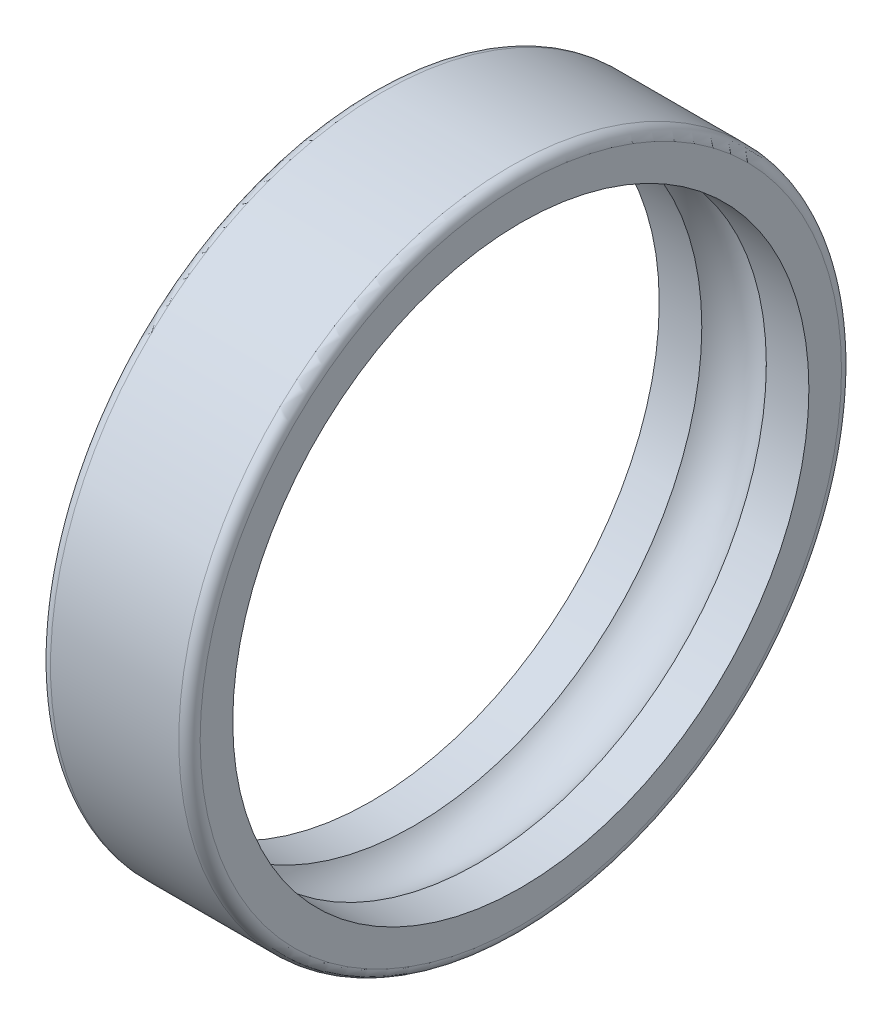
from build123d import *


with BuildPart() as part:
    # Esquisse1 → R_volution1 (revolve)
    with BuildSketch(Plane.XY, mode=Mode.PRIVATE) as r_volution1_sk:
        with BuildLine():
            Line((1, 31), (13, 31))
            ThreePointArc((13, 31), (13.707106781, 30.707106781), (14, 30))
            Line((14, 30), (14, 26.95))
            Line((14, 26.95), (10.01869177, 26.95))
            ThreePointArc((10.01869177, 26.95), (7, 28.3), (3.98130823, 26.95))
            Line((3.98130823, 26.95), (0, 26.95))
            Line((0, 26.95), (0, 30))
            ThreePointArc((0, 30), (0.292893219, 30.707106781), (1, 31))
        make_face()
    revolve(r_volution1_sk.sketch.rotate(Axis((0, 0, 0), (1, 0, 0)), 180), axis=Axis((0, 0, 0), (1, 0, 0)))


solid = part.part
